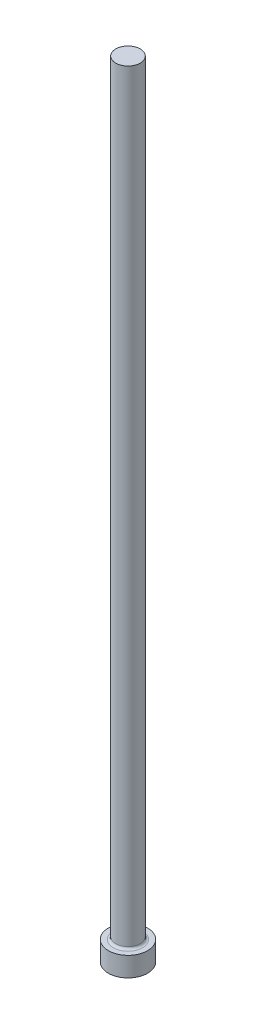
ISO-10303-21;
HEADER;
FILE_DESCRIPTION(('STEP AP214'),'2;1');
FILE_NAME('part.step','',(''),(''),'','','');
FILE_SCHEMA(('AUTOMOTIVE_DESIGN { 1 0 10303 214 1 1 1 1 }'));
ENDSEC;
DATA;
#1=APPLICATION_CONTEXT('core data for automotive mechanical design processes');
#2=APPLICATION_PROTOCOL_DEFINITION('international standard','automotive_design',2000,#1);
#3=PRODUCT_CONTEXT('',#1,'mechanical');
#4=PRODUCT('Part','Part','',(#3));
#5=PRODUCT_RELATED_PRODUCT_CATEGORY('part','',(#4));
#6=PRODUCT_DEFINITION_FORMATION('','',#4);
#7=PRODUCT_DEFINITION_CONTEXT('part definition',#1,'design');
#8=PRODUCT_DEFINITION('design','',#6,#7);
#9=PRODUCT_DEFINITION_SHAPE('','',#8);
#10=(LENGTH_UNIT() NAMED_UNIT(*) SI_UNIT(.MILLI.,.METRE.));
#11=(NAMED_UNIT(*) PLANE_ANGLE_UNIT() SI_UNIT($,.RADIAN.));
#12=(NAMED_UNIT(*) SI_UNIT($,.STERADIAN.) SOLID_ANGLE_UNIT());
#13=UNCERTAINTY_MEASURE_WITH_UNIT(LENGTH_MEASURE(1.E-05),#10,'distance_accuracy_value','');
#14=(GEOMETRIC_REPRESENTATION_CONTEXT(3) GLOBAL_UNCERTAINTY_ASSIGNED_CONTEXT((#13)) GLOBAL_UNIT_ASSIGNED_CONTEXT((#10,
#11,#12)) REPRESENTATION_CONTEXT('',''));
#15=CARTESIAN_POINT('',(0.,0.,0.));
#16=DIRECTION('',(0.,0.,1.));
#17=DIRECTION('',(1.,0.,0.));
#18=AXIS2_PLACEMENT_3D('',#15,#16,#17);
#19=CARTESIAN_POINT('',(3.96875000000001,254.,0.));
#20=DIRECTION('',(0.,-1.,0.));
#21=DIRECTION('',(1.,0.,0.));
#22=AXIS2_PLACEMENT_3D('',#19,#20,#21);
#23=PLANE('',#22);
#24=CARTESIAN_POINT('',(0.,254.,0.));
#25=DIRECTION('',(0.,1.,0.));
#26=DIRECTION('',(-1.,0.,0.));
#27=AXIS2_PLACEMENT_3D('',#24,#25,#26);
#28=CIRCLE('',#27,3.96875);
#29=CARTESIAN_POINT('',(-3.96874999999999,254.,0.));
#30=VERTEX_POINT('',#29);
#31=EDGE_CURVE('E10',#30,#30,#28,.T.);
#32=ORIENTED_EDGE('',*,*,#31,.T.);
#33=EDGE_LOOP('',(#32));
#34=FACE_BOUND('',#33,.T.);
#35=ADVANCED_FACE('F30',(#34),#23,.F.);
#36=CARTESIAN_POINT('',(0.,254.,0.));
#37=DIRECTION('',(0.,1.,0.));
#38=DIRECTION('',(-1.,0.,0.));
#39=AXIS2_PLACEMENT_3D('',#36,#37,#38);
#40=CYLINDRICAL_SURFACE('',#39,3.96875);
#41=ORIENTED_EDGE('',*,*,#31,.F.);
#42=EDGE_LOOP('',(#41));
#43=FACE_BOUND('',#42,.T.);
#44=CARTESIAN_POINT('',(0.,7.11200000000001,0.));
#45=DIRECTION('',(0.,1.,0.));
#46=DIRECTION('',(-1.,0.,0.));
#47=AXIS2_PLACEMENT_3D('',#44,#45,#46);
#48=CIRCLE('',#47,3.96875);
#49=CARTESIAN_POINT('',(-3.96875,7.11200000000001,0.));
#50=VERTEX_POINT('',#49);
#51=EDGE_CURVE('E36',#50,#50,#48,.T.);
#52=ORIENTED_EDGE('',*,*,#51,.T.);
#53=EDGE_LOOP('',(#52));
#54=FACE_BOUND('',#53,.T.);
#55=ADVANCED_FACE('F65',(#43,#54),#40,.T.);
#56=CARTESIAN_POINT('',(0.,7.112,0.));
#57=DIRECTION('',(0.,1.,0.));
#58=DIRECTION('',(-1.,0.,0.));
#59=AXIS2_PLACEMENT_3D('',#56,#57,#58);
#60=TOROIDAL_SURFACE('',#59,4.73075,0.762);
#61=ORIENTED_EDGE('',*,*,#51,.F.);
#62=EDGE_LOOP('',(#61));
#63=FACE_BOUND('',#62,.T.);
#64=CARTESIAN_POINT('',(0.,6.34999999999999,0.));
#65=DIRECTION('',(0.,1.,0.));
#66=DIRECTION('',(-1.,0.,0.));
#67=AXIS2_PLACEMENT_3D('',#64,#65,#66);
#68=CIRCLE('',#67,4.73075);
#69=CARTESIAN_POINT('',(-4.73075,6.34999999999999,0.));
#70=VERTEX_POINT('',#69);
#71=EDGE_CURVE('E40',#70,#70,#68,.T.);
#72=ORIENTED_EDGE('',*,*,#71,.T.);
#73=EDGE_LOOP('',(#72));
#74=FACE_BOUND('',#73,.T.);
#75=ADVANCED_FACE('F69',(#63,#74),#60,.F.);
#76=CARTESIAN_POINT('',(6.35,6.35,0.));
#77=DIRECTION('',(0.,-1.,0.));
#78=DIRECTION('',(1.,0.,0.));
#79=AXIS2_PLACEMENT_3D('',#76,#77,#78);
#80=PLANE('',#79);
#81=ORIENTED_EDGE('',*,*,#71,.F.);
#82=EDGE_LOOP('',(#81));
#83=FACE_BOUND('',#82,.T.);
#84=CARTESIAN_POINT('',(0.,6.34999999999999,0.));
#85=DIRECTION('',(0.,1.,0.));
#86=DIRECTION('',(-1.,0.,0.));
#87=AXIS2_PLACEMENT_3D('',#84,#85,#86);
#88=CIRCLE('',#87,6.35);
#89=CARTESIAN_POINT('',(-6.35,6.34999999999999,0.));
#90=VERTEX_POINT('',#89);
#91=EDGE_CURVE('E44',#90,#90,#88,.T.);
#92=ORIENTED_EDGE('',*,*,#91,.T.);
#93=EDGE_LOOP('',(#92));
#94=FACE_BOUND('',#93,.T.);
#95=ADVANCED_FACE('F61',(#83,#94),#80,.F.);
#96=CARTESIAN_POINT('',(0.,254.,0.));
#97=DIRECTION('',(0.,1.,0.));
#98=DIRECTION('',(-1.,0.,0.));
#99=AXIS2_PLACEMENT_3D('',#96,#97,#98);
#100=CYLINDRICAL_SURFACE('',#99,6.35);
#101=ORIENTED_EDGE('',*,*,#91,.F.);
#102=EDGE_LOOP('',(#101));
#103=FACE_BOUND('',#102,.T.);
#104=CARTESIAN_POINT('',(0.,0.,0.));
#105=DIRECTION('',(0.,1.,0.));
#106=DIRECTION('',(-1.,0.,0.));
#107=AXIS2_PLACEMENT_3D('',#104,#105,#106);
#108=CIRCLE('',#107,6.35);
#109=CARTESIAN_POINT('',(-6.35,0.,0.));
#110=VERTEX_POINT('',#109);
#111=EDGE_CURVE('E49',#110,#110,#108,.T.);
#112=ORIENTED_EDGE('',*,*,#111,.T.);
#113=EDGE_LOOP('',(#112));
#114=FACE_BOUND('',#113,.T.);
#115=ADVANCED_FACE('F53',(#103,#114),#100,.T.);
#116=CARTESIAN_POINT('',(0.,0.,0.));
#117=DIRECTION('',(0.,1.,0.));
#118=DIRECTION('',(-1.,0.,0.));
#119=AXIS2_PLACEMENT_3D('',#116,#117,#118);
#120=PLANE('',#119);
#121=ORIENTED_EDGE('',*,*,#111,.F.);
#122=EDGE_LOOP('',(#121));
#123=FACE_BOUND('',#122,.T.);
#124=ADVANCED_FACE('F55',(#123),#120,.F.);
#125=CLOSED_SHELL('',(#35,#55,#75,#95,#115,#124));
#126=MANIFOLD_SOLID_BREP('B2',#125);
#127=ADVANCED_BREP_SHAPE_REPRESENTATION('',(#18,#126),#14);
#128=SHAPE_DEFINITION_REPRESENTATION(#9,#127);
ENDSEC;
END-ISO-10303-21;
